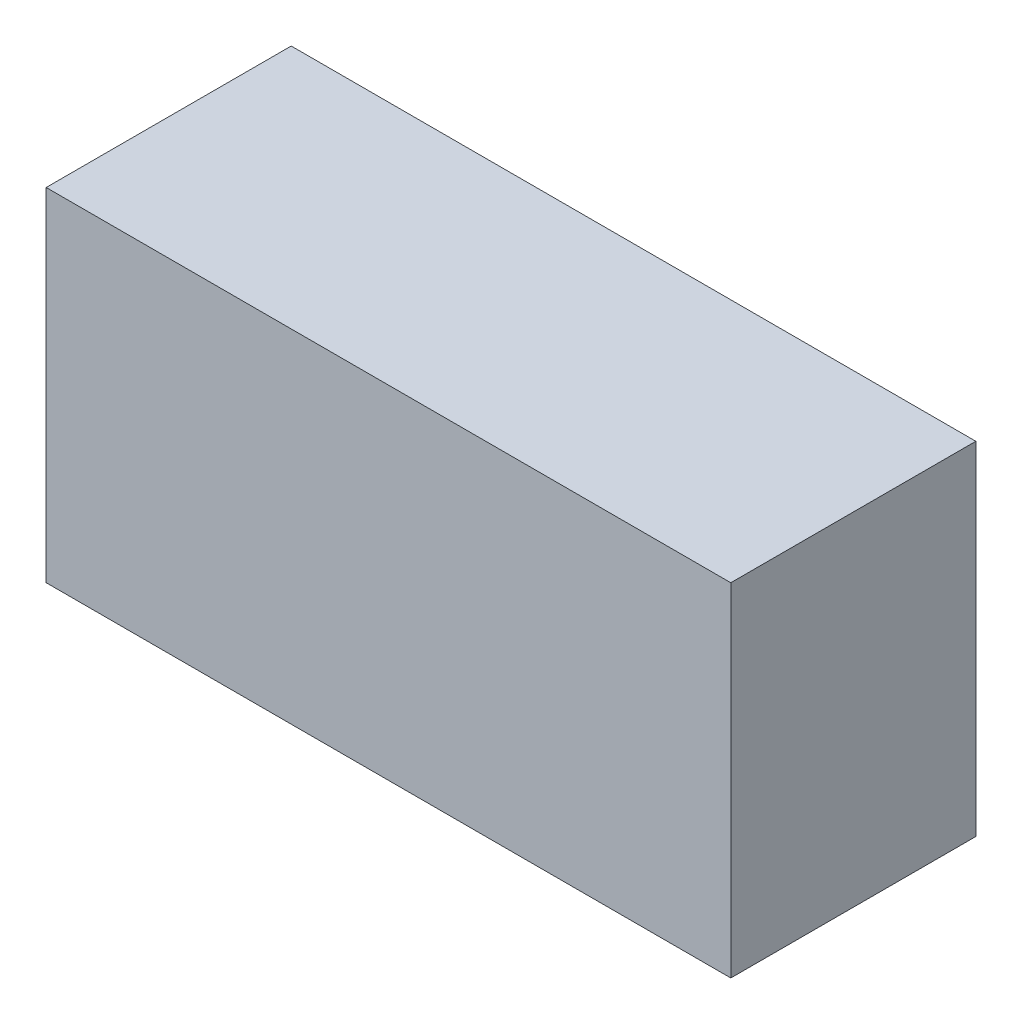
ISO-10303-21;
HEADER;
FILE_DESCRIPTION(('STEP AP214'),'2;1');
FILE_NAME('part.step','',(''),(''),'','','');
FILE_SCHEMA(('AUTOMOTIVE_DESIGN { 1 0 10303 214 1 1 1 1 }'));
ENDSEC;
DATA;
#1=APPLICATION_CONTEXT('core data for automotive mechanical design processes');
#2=APPLICATION_PROTOCOL_DEFINITION('international standard','automotive_design',2000,#1);
#3=PRODUCT_CONTEXT('',#1,'mechanical');
#4=PRODUCT('Part','Part','',(#3));
#5=PRODUCT_RELATED_PRODUCT_CATEGORY('part','',(#4));
#6=PRODUCT_DEFINITION_FORMATION('','',#4);
#7=PRODUCT_DEFINITION_CONTEXT('part definition',#1,'design');
#8=PRODUCT_DEFINITION('design','',#6,#7);
#9=PRODUCT_DEFINITION_SHAPE('','',#8);
#10=(LENGTH_UNIT() NAMED_UNIT(*) SI_UNIT(.MILLI.,.METRE.));
#11=(NAMED_UNIT(*) PLANE_ANGLE_UNIT() SI_UNIT($,.RADIAN.));
#12=(NAMED_UNIT(*) SI_UNIT($,.STERADIAN.) SOLID_ANGLE_UNIT());
#13=UNCERTAINTY_MEASURE_WITH_UNIT(LENGTH_MEASURE(1.E-05),#10,'distance_accuracy_value','');
#14=(GEOMETRIC_REPRESENTATION_CONTEXT(3) GLOBAL_UNCERTAINTY_ASSIGNED_CONTEXT((#13)) GLOBAL_UNIT_ASSIGNED_CONTEXT((#10,
#11,#12)) REPRESENTATION_CONTEXT('',''));
#15=CARTESIAN_POINT('',(0.,0.,0.));
#16=DIRECTION('',(0.,0.,1.));
#17=DIRECTION('',(1.,0.,0.));
#18=AXIS2_PLACEMENT_3D('',#15,#16,#17);
#19=CARTESIAN_POINT('',(-0.5588,-0.2794,0.4));
#20=DIRECTION('',(1.,0.,0.));
#21=DIRECTION('',(0.,0.,-1.));
#22=AXIS2_PLACEMENT_3D('',#19,#20,#21);
#23=PLANE('',#22);
#24=DIRECTION('',(0.,-1.,0.));
#25=VECTOR('',#24,1.);
#26=CARTESIAN_POINT('',(-0.5588,-0.2794,0.));
#27=LINE('',#26,#25);
#28=CARTESIAN_POINT('',(-0.5588,0.2794,0.));
#29=VERTEX_POINT('',#28);
#30=CARTESIAN_POINT('',(-0.5588,-0.2794,0.));
#31=VERTEX_POINT('',#30);
#32=EDGE_CURVE('E95',#29,#31,#27,.T.);
#33=ORIENTED_EDGE('',*,*,#32,.T.);
#34=DIRECTION('',(0.,0.,-1.));
#35=VECTOR('',#34,1.);
#36=CARTESIAN_POINT('',(-0.5588,-0.2794,0.4));
#37=LINE('',#36,#35);
#38=CARTESIAN_POINT('',(-0.5588,-0.2794,0.4));
#39=VERTEX_POINT('',#38);
#40=EDGE_CURVE('E11',#39,#31,#37,.T.);
#41=ORIENTED_EDGE('',*,*,#40,.F.);
#42=DIRECTION('',(0.,-1.,0.));
#43=VECTOR('',#42,1.);
#44=CARTESIAN_POINT('',(-0.5588,-0.2794,0.4));
#45=LINE('',#44,#43);
#46=CARTESIAN_POINT('',(-0.5588,0.2794,0.4));
#47=VERTEX_POINT('',#46);
#48=EDGE_CURVE('E83',#47,#39,#45,.T.);
#49=ORIENTED_EDGE('',*,*,#48,.F.);
#50=DIRECTION('',(0.,0.,-1.));
#51=VECTOR('',#50,1.);
#52=CARTESIAN_POINT('',(-0.5588,0.2794,0.4));
#53=LINE('',#52,#51);
#54=EDGE_CURVE('E91',#47,#29,#53,.T.);
#55=ORIENTED_EDGE('',*,*,#54,.T.);
#56=EDGE_LOOP('',(#33,#41,#49,#55));
#57=FACE_BOUND('',#56,.T.);
#58=ADVANCED_FACE('F32',(#57),#23,.F.);
#59=CARTESIAN_POINT('',(0.5588,-0.2794,0.4));
#60=DIRECTION('',(0.,1.,0.));
#61=DIRECTION('',(0.,0.,1.));
#62=AXIS2_PLACEMENT_3D('',#59,#60,#61);
#63=PLANE('',#62);
#64=DIRECTION('',(1.,0.,0.));
#65=VECTOR('',#64,1.);
#66=CARTESIAN_POINT('',(0.5588,-0.2794,0.));
#67=LINE('',#66,#65);
#68=CARTESIAN_POINT('',(0.5588,-0.2794,0.));
#69=VERTEX_POINT('',#68);
#70=EDGE_CURVE('E87',#31,#69,#67,.T.);
#71=ORIENTED_EDGE('',*,*,#70,.T.);
#72=DIRECTION('',(0.,0.,-1.));
#73=VECTOR('',#72,1.);
#74=CARTESIAN_POINT('',(0.5588,-0.2794,0.4));
#75=LINE('',#74,#73);
#76=CARTESIAN_POINT('',(0.5588,-0.2794,0.4));
#77=VERTEX_POINT('',#76);
#78=EDGE_CURVE('E40',#77,#69,#75,.T.);
#79=ORIENTED_EDGE('',*,*,#78,.F.);
#80=DIRECTION('',(1.,0.,0.));
#81=VECTOR('',#80,1.);
#82=CARTESIAN_POINT('',(0.5588,-0.2794,0.4));
#83=LINE('',#82,#81);
#84=EDGE_CURVE('E78',#39,#77,#83,.T.);
#85=ORIENTED_EDGE('',*,*,#84,.F.);
#86=ORIENTED_EDGE('',*,*,#40,.T.);
#87=EDGE_LOOP('',(#71,#79,#85,#86));
#88=FACE_BOUND('',#87,.T.);
#89=ADVANCED_FACE('F86',(#88),#63,.F.);
#90=CARTESIAN_POINT('',(0.5588,0.2794,0.4));
#91=DIRECTION('',(-1.,0.,0.));
#92=DIRECTION('',(0.,0.,1.));
#93=AXIS2_PLACEMENT_3D('',#90,#91,#92);
#94=PLANE('',#93);
#95=DIRECTION('',(0.,1.,0.));
#96=VECTOR('',#95,1.);
#97=CARTESIAN_POINT('',(0.5588,0.2794,0.));
#98=LINE('',#97,#96);
#99=CARTESIAN_POINT('',(0.5588,0.2794,0.));
#100=VERTEX_POINT('',#99);
#101=EDGE_CURVE('E65',#69,#100,#98,.T.);
#102=ORIENTED_EDGE('',*,*,#101,.T.);
#103=DIRECTION('',(0.,0.,-1.));
#104=VECTOR('',#103,1.);
#105=CARTESIAN_POINT('',(0.5588,0.2794,0.4));
#106=LINE('',#105,#104);
#107=CARTESIAN_POINT('',(0.5588,0.2794,0.4));
#108=VERTEX_POINT('',#107);
#109=EDGE_CURVE('E88',#108,#100,#106,.T.);
#110=ORIENTED_EDGE('',*,*,#109,.F.);
#111=DIRECTION('',(0.,1.,0.));
#112=VECTOR('',#111,1.);
#113=CARTESIAN_POINT('',(0.5588,0.2794,0.4));
#114=LINE('',#113,#112);
#115=EDGE_CURVE('E81',#77,#108,#114,.T.);
#116=ORIENTED_EDGE('',*,*,#115,.F.);
#117=ORIENTED_EDGE('',*,*,#78,.T.);
#118=EDGE_LOOP('',(#102,#110,#116,#117));
#119=FACE_BOUND('',#118,.T.);
#120=ADVANCED_FACE('F89',(#119),#94,.F.);
#121=CARTESIAN_POINT('',(-0.5588,0.2794,0.4));
#122=DIRECTION('',(0.,-1.,0.));
#123=DIRECTION('',(0.,0.,-1.));
#124=AXIS2_PLACEMENT_3D('',#121,#122,#123);
#125=PLANE('',#124);
#126=DIRECTION('',(-1.,0.,0.));
#127=VECTOR('',#126,1.);
#128=CARTESIAN_POINT('',(-0.5588,0.2794,0.));
#129=LINE('',#128,#127);
#130=EDGE_CURVE('E71',#100,#29,#129,.T.);
#131=ORIENTED_EDGE('',*,*,#130,.T.);
#132=ORIENTED_EDGE('',*,*,#54,.F.);
#133=DIRECTION('',(-1.,0.,0.));
#134=VECTOR('',#133,1.);
#135=CARTESIAN_POINT('',(-0.5588,0.2794,0.4));
#136=LINE('',#135,#134);
#137=EDGE_CURVE('E48',#108,#47,#136,.T.);
#138=ORIENTED_EDGE('',*,*,#137,.F.);
#139=ORIENTED_EDGE('',*,*,#109,.T.);
#140=EDGE_LOOP('',(#131,#132,#138,#139));
#141=FACE_BOUND('',#140,.T.);
#142=ADVANCED_FACE('F102',(#141),#125,.F.);
#143=CARTESIAN_POINT('',(0.,0.,0.4));
#144=DIRECTION('',(0.,0.,-1.));
#145=DIRECTION('',(-1.,0.,0.));
#146=AXIS2_PLACEMENT_3D('',#143,#144,#145);
#147=PLANE('',#146);
#148=ORIENTED_EDGE('',*,*,#48,.T.);
#149=ORIENTED_EDGE('',*,*,#84,.T.);
#150=ORIENTED_EDGE('',*,*,#115,.T.);
#151=ORIENTED_EDGE('',*,*,#137,.T.);
#152=EDGE_LOOP('',(#148,#149,#150,#151));
#153=FACE_BOUND('',#152,.T.);
#154=ADVANCED_FACE('F79',(#153),#147,.F.);
#155=CARTESIAN_POINT('',(0.,0.,0.));
#156=DIRECTION('',(0.,0.,-1.));
#157=DIRECTION('',(-1.,0.,0.));
#158=AXIS2_PLACEMENT_3D('',#155,#156,#157);
#159=PLANE('',#158);
#160=ORIENTED_EDGE('',*,*,#32,.F.);
#161=ORIENTED_EDGE('',*,*,#130,.F.);
#162=ORIENTED_EDGE('',*,*,#101,.F.);
#163=ORIENTED_EDGE('',*,*,#70,.F.);
#164=EDGE_LOOP('',(#160,#161,#162,#163));
#165=FACE_BOUND('',#164,.T.);
#166=ADVANCED_FACE('F105',(#165),#159,.T.);
#167=CLOSED_SHELL('',(#58,#89,#120,#142,#154,#166));
#168=MANIFOLD_SOLID_BREP('B2',#167);
#169=ADVANCED_BREP_SHAPE_REPRESENTATION('',(#18,#168),#14);
#170=SHAPE_DEFINITION_REPRESENTATION(#9,#169);
ENDSEC;
END-ISO-10303-21;
